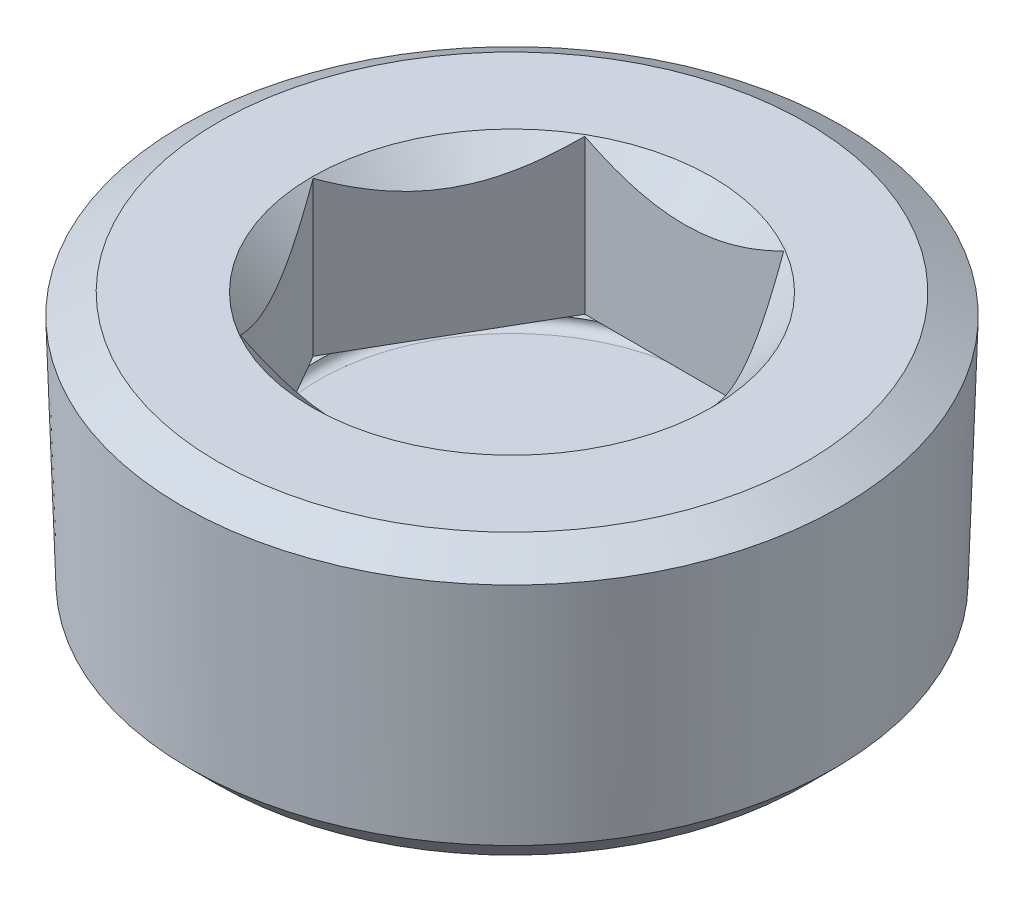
ISO-10303-21;
HEADER;
FILE_DESCRIPTION(('STEP AP214'),'2;1');
FILE_NAME('part.step','',(''),(''),'','','');
FILE_SCHEMA(('AUTOMOTIVE_DESIGN { 1 0 10303 214 1 1 1 1 }'));
ENDSEC;
DATA;
#1=APPLICATION_CONTEXT('core data for automotive mechanical design processes');
#2=APPLICATION_PROTOCOL_DEFINITION('international standard','automotive_design',2000,#1);
#3=PRODUCT_CONTEXT('',#1,'mechanical');
#4=PRODUCT('Part','Part','',(#3));
#5=PRODUCT_RELATED_PRODUCT_CATEGORY('part','',(#4));
#6=PRODUCT_DEFINITION_FORMATION('','',#4);
#7=PRODUCT_DEFINITION_CONTEXT('part definition',#1,'design');
#8=PRODUCT_DEFINITION('design','',#6,#7);
#9=PRODUCT_DEFINITION_SHAPE('','',#8);
#10=(LENGTH_UNIT() NAMED_UNIT(*) SI_UNIT(.MILLI.,.METRE.));
#11=(NAMED_UNIT(*) PLANE_ANGLE_UNIT() SI_UNIT($,.RADIAN.));
#12=(NAMED_UNIT(*) SI_UNIT($,.STERADIAN.) SOLID_ANGLE_UNIT());
#13=UNCERTAINTY_MEASURE_WITH_UNIT(LENGTH_MEASURE(1.E-05),#10,'distance_accuracy_value','');
#14=(GEOMETRIC_REPRESENTATION_CONTEXT(3) GLOBAL_UNCERTAINTY_ASSIGNED_CONTEXT((#13)) GLOBAL_UNIT_ASSIGNED_CONTEXT((#10,
#11,#12)) REPRESENTATION_CONTEXT('',''));
#15=CARTESIAN_POINT('',(0.,0.,0.));
#16=DIRECTION('',(0.,0.,1.));
#17=DIRECTION('',(1.,0.,0.));
#18=AXIS2_PLACEMENT_3D('',#15,#16,#17);
#19=CARTESIAN_POINT('',(0.,0.,0.));
#20=DIRECTION('',(0.,1.,0.));
#21=DIRECTION('',(0.,0.,1.));
#22=AXIS2_PLACEMENT_3D('',#19,#20,#21);
#23=PLANE('',#22);
#24=CARTESIAN_POINT('',(0.,0.,0.));
#25=DIRECTION('',(0.,1.,0.));
#26=DIRECTION('',(0.,0.,1.));
#27=AXIS2_PLACEMENT_3D('',#24,#25,#26);
#28=CIRCLE('',#27,14.732);
#29=CARTESIAN_POINT('',(0.,0.,14.732));
#30=VERTEX_POINT('',#29);
#31=EDGE_CURVE('E178',#30,#30,#28,.T.);
#32=ORIENTED_EDGE('',*,*,#31,.F.);
#33=EDGE_LOOP('',(#32));
#34=FACE_BOUND('',#33,.T.);
#35=CARTESIAN_POINT('',(0.,0.,0.));
#36=DIRECTION('',(0.,1.,0.));
#37=DIRECTION('',(0.,0.,1.));
#38=AXIS2_PLACEMENT_3D('',#35,#36,#37);
#39=CIRCLE('',#38,21.6827634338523);
#40=CARTESIAN_POINT('',(0.,0.,21.6827634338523));
#41=VERTEX_POINT('',#40);
#42=EDGE_CURVE('E12',#41,#41,#39,.T.);
#43=ORIENTED_EDGE('',*,*,#42,.T.);
#44=EDGE_LOOP('',(#43));
#45=FACE_BOUND('',#44,.T.);
#46=ADVANCED_FACE('F34',(#34,#45),#23,.T.);
#47=CARTESIAN_POINT('',(0.,0.,0.));
#48=DIRECTION('',(0.,-1.,0.));
#49=DIRECTION('',(0.,0.,-1.));
#50=AXIS2_PLACEMENT_3D('',#47,#48,#49);
#51=CONICAL_SURFACE('',#50,21.6827634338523,1.0471975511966);
#52=CARTESIAN_POINT('',(0.,-1.51754437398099,0.));
#53=DIRECTION('',(0.,1.,0.));
#54=DIRECTION('',(0.,0.,1.));
#55=AXIS2_PLACEMENT_3D('',#52,#53,#54);
#56=CIRCLE('',#55,24.3112273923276);
#57=CARTESIAN_POINT('',(0.,-1.51754437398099,24.3112273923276));
#58=VERTEX_POINT('',#57);
#59=EDGE_CURVE('E41',#58,#58,#56,.T.);
#60=ORIENTED_EDGE('',*,*,#59,.T.);
#61=EDGE_LOOP('',(#60));
#62=FACE_BOUND('',#61,.T.);
#63=ORIENTED_EDGE('',*,*,#42,.F.);
#64=EDGE_LOOP('',(#63));
#65=FACE_BOUND('',#64,.T.);
#66=ADVANCED_FACE('F192',(#62,#65),#51,.T.);
#67=CARTESIAN_POINT('',(0.,-1.51754437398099,0.));
#68=DIRECTION('',(0.,1.,0.));
#69=DIRECTION('',(0.,0.,1.));
#70=AXIS2_PLACEMENT_3D('',#67,#68,#69);
#71=CONICAL_SURFACE('',#70,24.3112273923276,0.0312064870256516);
#72=CARTESIAN_POINT('',(0.,-18.5273238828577,0.));
#73=DIRECTION('',(0.,1.,0.));
#74=DIRECTION('',(0.,0.,1.));
#75=AXIS2_PLACEMENT_3D('',#72,#73,#74);
#76=CIRCLE('',#75,23.7802395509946);
#77=CARTESIAN_POINT('',(0.,-18.5273238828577,23.7802395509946));
#78=VERTEX_POINT('',#77);
#79=EDGE_CURVE('E187',#78,#78,#76,.T.);
#80=ORIENTED_EDGE('',*,*,#79,.T.);
#81=EDGE_LOOP('',(#80));
#82=FACE_BOUND('',#81,.T.);
#83=ORIENTED_EDGE('',*,*,#59,.F.);
#84=EDGE_LOOP('',(#83));
#85=FACE_BOUND('',#84,.T.);
#86=ADVANCED_FACE('F195',(#82,#85),#71,.T.);
#87=CARTESIAN_POINT('',(0.,-18.5273238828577,0.));
#88=DIRECTION('',(0.,1.,0.));
#89=DIRECTION('',(0.,0.,1.));
#90=AXIS2_PLACEMENT_3D('',#87,#88,#89);
#91=CONICAL_SURFACE('',#90,23.7802395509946,0.785398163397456);
#92=CARTESIAN_POINT('',(0.,-20.6248,0.));
#93=DIRECTION('',(0.,1.,0.));
#94=DIRECTION('',(0.,0.,1.));
#95=AXIS2_PLACEMENT_3D('',#92,#93,#94);
#96=CIRCLE('',#95,21.6827634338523);
#97=CARTESIAN_POINT('',(0.,-20.6248,21.6827634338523));
#98=VERTEX_POINT('',#97);
#99=EDGE_CURVE('E184',#98,#98,#96,.T.);
#100=ORIENTED_EDGE('',*,*,#99,.T.);
#101=EDGE_LOOP('',(#100));
#102=FACE_BOUND('',#101,.T.);
#103=ORIENTED_EDGE('',*,*,#79,.F.);
#104=EDGE_LOOP('',(#103));
#105=FACE_BOUND('',#104,.T.);
#106=ADVANCED_FACE('F197',(#102,#105),#91,.T.);
#107=CARTESIAN_POINT('',(-21.6827634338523,-20.6248,0.));
#108=DIRECTION('',(0.,-1.,0.));
#109=DIRECTION('',(0.,0.,-1.));
#110=AXIS2_PLACEMENT_3D('',#107,#108,#109);
#111=PLANE('',#110);
#112=ORIENTED_EDGE('',*,*,#99,.F.);
#113=EDGE_LOOP('',(#112));
#114=FACE_BOUND('',#113,.T.);
#115=ADVANCED_FACE('F204',(#114),#111,.T.);
#116=CARTESIAN_POINT('',(0.,0.,0.));
#117=DIRECTION('',(0.,1.,0.));
#118=DIRECTION('',(0.,0.,1.));
#119=AXIS2_PLACEMENT_3D('',#116,#117,#118);
#120=CONICAL_SURFACE('',#119,14.732,0.785398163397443);
#121=CARTESIAN_POINT('',(-15.3291894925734,5.17463332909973,12.7));
#122=CARTESIAN_POINT('',(-14.9589479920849,4.88959123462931,12.7));
#123=CARTESIAN_POINT('',(-14.5867146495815,4.60709574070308,12.7));
#124=CARTESIAN_POINT('',(-13.8374490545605,4.04836230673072,12.7));
#125=CARTESIAN_POINT('',(-13.4604156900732,3.77212585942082,12.7));
#126=CARTESIAN_POINT('',(-12.6979798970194,3.22510913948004,12.7));
#127=CARTESIAN_POINT('',(-12.3125353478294,2.95438738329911,12.7));
#128=CARTESIAN_POINT('',(-11.5352366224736,2.42233918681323,12.7));
#129=CARTESIAN_POINT('',(-11.1433828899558,2.16101210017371,12.7));
#130=CARTESIAN_POINT('',(-10.3270006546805,1.63362575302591,12.7));
#131=CARTESIAN_POINT('',(-9.90198012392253,1.36832433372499,12.7));
#132=CARTESIAN_POINT('',(-9.0419558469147,0.854150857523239,12.7));
#133=CARTESIAN_POINT('',(-8.60695043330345,0.605281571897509,12.7));
#134=CARTESIAN_POINT('',(-7.72683347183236,0.129269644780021,12.7));
#135=CARTESIAN_POINT('',(-7.28175668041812,-0.0979367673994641,12.7));
#136=CARTESIAN_POINT('',(-6.3789973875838,-0.525532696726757,12.7));
#137=CARTESIAN_POINT('',(-5.92132096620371,-0.725934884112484,12.7));
#138=CARTESIAN_POINT('',(-5.03853629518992,-1.07443088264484,12.7));
#139=CARTESIAN_POINT('',(-4.61470922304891,-1.22574334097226,12.7));
#140=CARTESIAN_POINT('',(-3.75615169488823,-1.49444779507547,12.7));
#141=CARTESIAN_POINT('',(-3.32142054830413,-1.6118376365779,12.7));
#142=CARTESIAN_POINT('',(-2.66688443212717,-1.75671421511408,12.7));
#143=CARTESIAN_POINT('',(-2.45041353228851,-1.79953502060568,12.7));
#144=CARTESIAN_POINT('',(-2.01568738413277,-1.87481478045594,12.7));
#145=CARTESIAN_POINT('',(-1.79743238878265,-1.90727517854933,12.7));
#146=CARTESIAN_POINT('',(-1.35959203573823,-1.96127985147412,12.7));
#147=CARTESIAN_POINT('',(-1.14000679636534,-1.98282508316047,12.7));
#148=CARTESIAN_POINT('',(-0.700016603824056,-2.0146147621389,12.7));
#149=CARTESIAN_POINT('',(-0.479611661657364,-2.02485936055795,12.7));
#150=CARTESIAN_POINT('',(-0.048288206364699,-2.03365728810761,12.7));
#151=CARTESIAN_POINT('',(0.162620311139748,-2.0327059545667,12.7));
#152=CARTESIAN_POINT('',(0.584151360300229,-2.02031870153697,12.7));
#153=CARTESIAN_POINT('',(0.794773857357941,-2.00888161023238,12.7));
#154=CARTESIAN_POINT('',(1.21519356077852,-1.97571555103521,12.7));
#155=CARTESIAN_POINT('',(1.42499081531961,-1.95398719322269,12.7));
#156=CARTESIAN_POINT('',(1.84332802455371,-1.90060227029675,12.7));
#157=CARTESIAN_POINT('',(2.05186780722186,-1.86894437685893,12.7));
#158=CARTESIAN_POINT('',(2.68244777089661,-1.75846982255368,12.7));
#159=CARTESIAN_POINT('',(3.10194616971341,-1.66476681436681,12.7));
#160=CARTESIAN_POINT('',(3.93162363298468,-1.44337797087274,12.7));
#161=CARTESIAN_POINT('',(4.34180321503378,-1.31569402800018,12.7));
#162=CARTESIAN_POINT('',(5.17500836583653,-1.02397670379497,12.7));
#163=CARTESIAN_POINT('',(5.59745269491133,-0.858298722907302,12.7));
#164=CARTESIAN_POINT('',(6.43147266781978,-0.501341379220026,12.7));
#165=CARTESIAN_POINT('',(6.84304331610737,-0.310050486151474,12.7));
#166=CARTESIAN_POINT('',(7.65726509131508,0.0935964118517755,12.7));
#167=CARTESIAN_POINT('',(8.05988381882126,0.306017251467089,12.7));
#168=CARTESIAN_POINT('',(8.85589628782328,0.747250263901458,12.7));
#169=CARTESIAN_POINT('',(9.24929143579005,0.976059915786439,12.7));
#170=CARTESIAN_POINT('',(10.008839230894,1.43524962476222,12.7));
#171=CARTESIAN_POINT('',(10.37537796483,1.66499441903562,12.7));
#172=CARTESIAN_POINT('',(11.1021578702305,2.13426677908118,12.7));
#173=CARTESIAN_POINT('',(11.4623985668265,2.37379507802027,12.7));
#174=CARTESIAN_POINT('',(12.1745109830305,2.85894094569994,12.7));
#175=CARTESIAN_POINT('',(12.5264266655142,3.10449421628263,12.7));
#176=CARTESIAN_POINT('',(13.2254296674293,3.60218595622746,12.7));
#177=CARTESIAN_POINT('',(13.5725182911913,3.85432259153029,12.7));
#178=CARTESIAN_POINT('',(13.917581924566,4.10915406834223,12.7));
#179=B_SPLINE_CURVE_WITH_KNOTS('',3,(#121,#122,#123,#124,#125,#126,#127,#128,#129,#130,#131,
#132,#133,#134,#135,#136,#137,#138,#139,#140,#141,#142,#143,#144,#145,#146,#147,#148,#149,#150,
#151,#152,#153,#154,#155,#156,#157,#158,#159,#160,#161,#162,#163,#164,#165,#166,#167,#168,#169,
#170,#171,#172,#173,#174,#175,#176,#177,#178),.UNSPECIFIED.,.F.,.F.,(4,2,2,2,2,2,2,2,2,2,2,2,2,
2,2,2,2,2,2,2,2,2,2,2,2,2,2,2,4),(0.,1.40179234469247,2.80391556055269,4.21685329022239,
5.62969362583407,7.13247727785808,8.63551372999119,10.1339793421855,11.6317341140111,
12.9807032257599,14.3297579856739,14.991546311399,15.6532423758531,16.3148804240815,
16.9765096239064,17.608980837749,18.2415227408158,18.8740271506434,19.5066162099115,
20.7942875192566,22.0818871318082,23.4421454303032,24.8030181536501,26.168203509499,
27.5331793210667,28.8307644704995,30.128447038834,31.4157149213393,32.7026279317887),.UNSPECIFIED.);
#180=CARTESIAN_POINT('',(7.33234841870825,-0.0673031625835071,12.7));
#181=VERTEX_POINT('',#180);
#182=CARTESIAN_POINT('',(-7.33234841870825,-0.0673031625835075,12.7));
#183=VERTEX_POINT('',#182);
#184=EDGE_CURVE('E48',#181,#183,#179,.F.);
#185=ORIENTED_EDGE('',*,*,#184,.T.);
#186=CARTESIAN_POINT('',(-7.33223294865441,-0.0671876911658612,12.7002));
#187=CARTESIAN_POINT('',(-7.45829190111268,-0.193227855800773,12.4818594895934));
#188=CARTESIAN_POINT('',(-7.58533809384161,-0.315421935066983,12.2618090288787));
#189=CARTESIAN_POINT('',(-7.84155862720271,-0.550896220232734,11.8180220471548));
#190=CARTESIAN_POINT('',(-7.97073408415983,-0.66417155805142,11.5942835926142));
#191=CARTESIAN_POINT('',(-8.23197607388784,-0.881066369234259,11.1417991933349));
#192=CARTESIAN_POINT('',(-8.364054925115,-0.984626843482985,10.9130319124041));
#193=CARTESIAN_POINT('',(-8.63038195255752,-1.17984271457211,10.4517399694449));
#194=CARTESIAN_POINT('',(-8.76462979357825,-1.27149993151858,10.2192158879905));
#195=CARTESIAN_POINT('',(-9.03313634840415,-1.44000927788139,9.75414889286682));
#196=CARTESIAN_POINT('',(-9.16736206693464,-1.51707050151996,9.52166312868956));
#197=CARTESIAN_POINT('',(-9.43769508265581,-1.65658272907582,9.05343261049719));
#198=CARTESIAN_POINT('',(-9.57380217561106,-1.71903530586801,8.81768821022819));
#199=CARTESIAN_POINT('',(-9.84731577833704,-1.82775795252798,8.34394875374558));
#200=CARTESIAN_POINT('',(-9.98471863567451,-1.874064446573,8.10596002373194));
#201=CARTESIAN_POINT('',(-10.2606778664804,-1.94947741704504,7.62798461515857));
#202=CARTESIAN_POINT('',(-10.3992340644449,-1.97858646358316,7.38799824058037));
#203=CARTESIAN_POINT('',(-10.7368852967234,-2.02739428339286,6.80316915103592));
#204=CARTESIAN_POINT('',(-10.9363452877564,-2.03763638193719,6.45769431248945));
#205=CARTESIAN_POINT('',(-11.3349045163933,-2.02044398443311,5.7673694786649));
#206=CARTESIAN_POINT('',(-11.5340036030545,-1.99299628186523,5.4225197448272));
#207=CARTESIAN_POINT('',(-11.9303249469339,-1.90204439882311,4.7360710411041));
#208=CARTESIAN_POINT('',(-12.1275448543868,-1.83849990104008,4.39447614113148));
#209=CARTESIAN_POINT('',(-12.5185948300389,-1.67880849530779,3.7171577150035));
#210=CARTESIAN_POINT('',(-12.7124251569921,-1.58266408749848,3.38143374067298));
#211=CARTESIAN_POINT('',(-13.0564965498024,-1.38487297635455,2.78548460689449));
#212=CARTESIAN_POINT('',(-13.207499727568,-1.28842963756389,2.52393943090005));
#213=CARTESIAN_POINT('',(-13.5067956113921,-1.08000258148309,2.00554375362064));
#214=CARTESIAN_POINT('',(-13.6550882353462,-0.968018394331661,1.74869339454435));
#215=CARTESIAN_POINT('',(-13.9484959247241,-0.731019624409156,1.24049636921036));
#216=CARTESIAN_POINT('',(-14.0936193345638,-0.606046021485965,0.989135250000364));
#217=CARTESIAN_POINT('',(-14.3811790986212,-0.34470890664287,0.491067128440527));
#218=CARTESIAN_POINT('',(-14.5236170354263,-0.208352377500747,0.2443573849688));
#219=CARTESIAN_POINT('',(-14.6648123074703,-0.0671876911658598,-0.00019999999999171));
#220=B_SPLINE_CURVE_WITH_KNOTS('',3,(#186,#187,#188,#189,#190,#191,#192,#193,#194,#195,#196,
#197,#198,#199,#200,#201,#202,#203,#204,#205,#206,#207,#208,#209,#210,#211,#212,#213,#214,#215,
#216,#217,#218,#219),.UNSPECIFIED.,.F.,.F.,(4,2,2,2,2,2,2,2,2,2,2,2,2,2,2,2,4),(0.,
0.845639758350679,1.69173793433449,2.54268053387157,3.39349286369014,4.23100113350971,
5.06841918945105,5.90393569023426,6.73932729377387,7.9346157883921,9.13032321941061,
10.3273687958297,11.5243225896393,12.4749718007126,13.4256497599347,14.3734146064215,
15.3206022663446),.UNSPECIFIED.);
#221=CARTESIAN_POINT('',(-14.6646968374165,-0.0673031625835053,0.));
#222=VERTEX_POINT('',#221);
#223=EDGE_CURVE('E141',#183,#222,#220,.T.);
#224=ORIENTED_EDGE('',*,*,#223,.T.);
#225=CARTESIAN_POINT('',(-14.6648123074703,-0.0671876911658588,0.00020000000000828));
#226=CARTESIAN_POINT('',(-14.5387533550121,-0.193227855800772,-0.218140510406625));
#227=CARTESIAN_POINT('',(-14.4117071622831,-0.315421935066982,-0.438190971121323));
#228=CARTESIAN_POINT('',(-14.155486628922,-0.550896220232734,-0.881977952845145));
#229=CARTESIAN_POINT('',(-14.0263111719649,-0.66417155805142,-1.10571640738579));
#230=CARTESIAN_POINT('',(-13.7650691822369,-0.881066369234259,-1.5582008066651));
#231=CARTESIAN_POINT('',(-13.6329903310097,-0.984626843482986,-1.78696808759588));
#232=CARTESIAN_POINT('',(-13.3666633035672,-1.17984271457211,-2.24826003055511));
#233=CARTESIAN_POINT('',(-13.2324154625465,-1.27149993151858,-2.48078411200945));
#234=CARTESIAN_POINT('',(-12.9639089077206,-1.44000927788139,-2.94585110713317));
#235=CARTESIAN_POINT('',(-12.8296831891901,-1.51707050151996,-3.17833687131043));
#236=CARTESIAN_POINT('',(-12.5593501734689,-1.65658272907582,-3.64656738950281));
#237=CARTESIAN_POINT('',(-12.4232430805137,-1.71903530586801,-3.8823117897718));
#238=CARTESIAN_POINT('',(-12.1497294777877,-1.82775795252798,-4.35605124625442));
#239=CARTESIAN_POINT('',(-12.0123266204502,-1.87406444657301,-4.59403997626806));
#240=CARTESIAN_POINT('',(-11.7363673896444,-1.94947741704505,-5.07201538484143));
#241=CARTESIAN_POINT('',(-11.5978111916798,-1.97858646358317,-5.31200175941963));
#242=CARTESIAN_POINT('',(-11.2601599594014,-2.02739428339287,-5.89683084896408));
#243=CARTESIAN_POINT('',(-11.0606999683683,-2.03763638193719,-6.24230568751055));
#244=CARTESIAN_POINT('',(-10.6621407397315,-2.02044398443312,-6.9326305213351));
#245=CARTESIAN_POINT('',(-10.4630416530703,-1.99299628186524,-7.2774802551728));
#246=CARTESIAN_POINT('',(-10.0667203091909,-1.90204439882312,-7.9639289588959));
#247=CARTESIAN_POINT('',(-9.86950040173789,-1.83849990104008,-8.30552385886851));
#248=CARTESIAN_POINT('',(-9.47845042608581,-1.67880849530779,-8.9828422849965));
#249=CARTESIAN_POINT('',(-9.28462009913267,-1.58266408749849,-9.31856625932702));
#250=CARTESIAN_POINT('',(-8.94054870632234,-1.38487297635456,-9.91451539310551));
#251=CARTESIAN_POINT('',(-8.7895455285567,-1.2884296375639,-10.1760605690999));
#252=CARTESIAN_POINT('',(-8.49024964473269,-1.0800025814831,-10.6944562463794));
#253=CARTESIAN_POINT('',(-8.34195702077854,-0.968018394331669,-10.9513066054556));
#254=CARTESIAN_POINT('',(-8.0485493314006,-0.731019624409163,-11.4595036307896));
#255=CARTESIAN_POINT('',(-7.9034259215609,-0.606046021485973,-11.7108647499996));
#256=CARTESIAN_POINT('',(-7.61586615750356,-0.344708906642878,-12.2089328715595));
#257=CARTESIAN_POINT('',(-7.47342822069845,-0.208352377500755,-12.4556426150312));
#258=CARTESIAN_POINT('',(-7.33223294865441,-0.0671876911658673,-12.7002));
#259=B_SPLINE_CURVE_WITH_KNOTS('',3,(#225,#226,#227,#228,#229,#230,#231,#232,#233,#234,#235,
#236,#237,#238,#239,#240,#241,#242,#243,#244,#245,#246,#247,#248,#249,#250,#251,#252,#253,#254,
#255,#256,#257,#258),.UNSPECIFIED.,.F.,.F.,(4,2,2,2,2,2,2,2,2,2,2,2,2,2,2,2,4),(0.,
0.84563975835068,1.6917379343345,2.54268053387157,3.39349286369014,4.23100113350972,
5.06841918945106,5.90393569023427,6.73932729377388,7.93461578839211,9.13032321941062,
10.3273687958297,11.5243225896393,12.4749718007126,13.4256497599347,14.3734146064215,
15.3206022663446),.UNSPECIFIED.);
#260=CARTESIAN_POINT('',(-7.33234841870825,-0.0673031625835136,-12.7));
#261=VERTEX_POINT('',#260);
#262=EDGE_CURVE('E263',#222,#261,#259,.T.);
#263=ORIENTED_EDGE('',*,*,#262,.T.);
#264=CARTESIAN_POINT('',(-15.3291894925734,5.17463332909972,-12.7));
#265=CARTESIAN_POINT('',(-14.9589479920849,4.8895912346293,-12.7));
#266=CARTESIAN_POINT('',(-14.5867146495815,4.60709574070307,-12.7));
#267=CARTESIAN_POINT('',(-13.8374490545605,4.04836230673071,-12.7));
#268=CARTESIAN_POINT('',(-13.4604156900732,3.77212585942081,-12.7));
#269=CARTESIAN_POINT('',(-12.6979798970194,3.22510913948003,-12.7));
#270=CARTESIAN_POINT('',(-12.3125353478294,2.95438738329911,-12.7));
#271=CARTESIAN_POINT('',(-11.5352366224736,2.42233918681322,-12.7));
#272=CARTESIAN_POINT('',(-11.1433828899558,2.1610121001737,-12.7));
#273=CARTESIAN_POINT('',(-10.3270006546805,1.6336257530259,-12.7));
#274=CARTESIAN_POINT('',(-9.90198012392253,1.36832433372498,-12.7));
#275=CARTESIAN_POINT('',(-9.0419558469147,0.854150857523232,-12.7));
#276=CARTESIAN_POINT('',(-8.60695043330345,0.6052815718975,-12.7));
#277=CARTESIAN_POINT('',(-7.72683347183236,0.129269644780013,-12.7));
#278=CARTESIAN_POINT('',(-7.28175668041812,-0.0979367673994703,-12.7));
#279=CARTESIAN_POINT('',(-6.3789973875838,-0.525532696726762,-12.7));
#280=CARTESIAN_POINT('',(-5.92132096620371,-0.725934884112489,-12.7));
#281=CARTESIAN_POINT('',(-5.03853629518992,-1.07443088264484,-12.7));
#282=CARTESIAN_POINT('',(-4.61470922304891,-1.22574334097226,-12.7));
#283=CARTESIAN_POINT('',(-3.75615169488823,-1.49444779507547,-12.7));
#284=CARTESIAN_POINT('',(-3.32142054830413,-1.6118376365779,-12.7));
#285=CARTESIAN_POINT('',(-2.66688443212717,-1.75671421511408,-12.7));
#286=CARTESIAN_POINT('',(-2.45041353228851,-1.79953502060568,-12.7));
#287=CARTESIAN_POINT('',(-2.01568738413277,-1.87481478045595,-12.7));
#288=CARTESIAN_POINT('',(-1.79743238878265,-1.90727517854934,-12.7));
#289=CARTESIAN_POINT('',(-1.35959203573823,-1.96127985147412,-12.7));
#290=CARTESIAN_POINT('',(-1.14000679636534,-1.98282508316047,-12.7));
#291=CARTESIAN_POINT('',(-0.70001660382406,-2.01461476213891,-12.7));
#292=CARTESIAN_POINT('',(-0.479611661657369,-2.02485936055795,-12.7));
#293=CARTESIAN_POINT('',(-0.0482882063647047,-2.03365728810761,-12.7));
#294=CARTESIAN_POINT('',(0.162620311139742,-2.03270595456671,-12.7));
#295=CARTESIAN_POINT('',(0.584151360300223,-2.02031870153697,-12.7));
#296=CARTESIAN_POINT('',(0.794773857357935,-2.00888161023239,-12.7));
#297=CARTESIAN_POINT('',(1.21519356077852,-1.97571555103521,-12.7));
#298=CARTESIAN_POINT('',(1.4249908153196,-1.95398719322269,-12.7));
#299=CARTESIAN_POINT('',(1.8433280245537,-1.90060227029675,-12.7));
#300=CARTESIAN_POINT('',(2.05186780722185,-1.86894437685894,-12.7));
#301=CARTESIAN_POINT('',(2.6824477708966,-1.75846982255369,-12.7));
#302=CARTESIAN_POINT('',(3.1019461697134,-1.66476681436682,-12.7));
#303=CARTESIAN_POINT('',(3.93162363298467,-1.44337797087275,-12.7));
#304=CARTESIAN_POINT('',(4.34180321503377,-1.31569402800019,-12.7));
#305=CARTESIAN_POINT('',(5.17500836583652,-1.02397670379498,-12.7));
#306=CARTESIAN_POINT('',(5.59745269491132,-0.858298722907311,-12.7));
#307=CARTESIAN_POINT('',(6.43147266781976,-0.501341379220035,-12.7));
#308=CARTESIAN_POINT('',(6.84304331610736,-0.310050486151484,-12.7));
#309=CARTESIAN_POINT('',(7.65726509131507,0.0935964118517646,-12.7));
#310=CARTESIAN_POINT('',(8.05988381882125,0.306017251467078,-12.7));
#311=CARTESIAN_POINT('',(8.85589628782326,0.747250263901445,-12.7));
#312=CARTESIAN_POINT('',(9.24929143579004,0.976059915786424,-12.7));
#313=CARTESIAN_POINT('',(10.008839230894,1.43524962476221,-12.7));
#314=CARTESIAN_POINT('',(10.3753779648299,1.66499441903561,-12.7));
#315=CARTESIAN_POINT('',(11.1021578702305,2.13426677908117,-12.7));
#316=CARTESIAN_POINT('',(11.4623985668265,2.37379507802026,-12.7));
#317=CARTESIAN_POINT('',(12.1745109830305,2.85894094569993,-12.7));
#318=CARTESIAN_POINT('',(12.5264266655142,3.10449421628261,-12.7));
#319=CARTESIAN_POINT('',(13.2254296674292,3.60218595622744,-12.7));
#320=CARTESIAN_POINT('',(13.5725182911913,3.85432259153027,-12.7));
#321=CARTESIAN_POINT('',(13.917581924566,4.10915406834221,-12.7));
#322=B_SPLINE_CURVE_WITH_KNOTS('',3,(#264,#265,#266,#267,#268,#269,#270,#271,#272,#273,#274,
#275,#276,#277,#278,#279,#280,#281,#282,#283,#284,#285,#286,#287,#288,#289,#290,#291,#292,#293,
#294,#295,#296,#297,#298,#299,#300,#301,#302,#303,#304,#305,#306,#307,#308,#309,#310,#311,#312,
#313,#314,#315,#316,#317,#318,#319,#320,#321),.UNSPECIFIED.,.F.,.F.,(4,2,2,2,2,2,2,2,2,2,2,2,2,
2,2,2,2,2,2,2,2,2,2,2,2,2,2,2,4),(0.,1.40179234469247,2.80391556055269,4.21685329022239,
5.62969362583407,7.13247727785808,8.63551372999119,10.1339793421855,11.6317341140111,
12.9807032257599,14.3297579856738,14.991546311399,15.6532423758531,16.3148804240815,
16.9765096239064,17.608980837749,18.2415227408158,18.8740271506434,19.5066162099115,
20.7942875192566,22.0818871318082,23.4421454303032,24.80301815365,26.168203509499,
27.5331793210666,28.8307644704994,30.128447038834,31.4157149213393,32.7026279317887),.UNSPECIFIED.);
#323=CARTESIAN_POINT('',(7.33234841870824,-0.0673031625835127,-12.7));
#324=VERTEX_POINT('',#323);
#325=EDGE_CURVE('E256',#261,#324,#322,.T.);
#326=ORIENTED_EDGE('',*,*,#325,.T.);
#327=CARTESIAN_POINT('',(7.33223294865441,-0.0671876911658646,-12.7002));
#328=CARTESIAN_POINT('',(7.45829190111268,-0.193227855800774,-12.4818594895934));
#329=CARTESIAN_POINT('',(7.58533809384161,-0.315421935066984,-12.2618090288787));
#330=CARTESIAN_POINT('',(7.84155862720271,-0.550896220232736,-11.8180220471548));
#331=CARTESIAN_POINT('',(7.97073408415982,-0.664171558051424,-11.5942835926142));
#332=CARTESIAN_POINT('',(8.23197607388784,-0.881066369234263,-11.1417991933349));
#333=CARTESIAN_POINT('',(8.364054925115,-0.984626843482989,-10.9130319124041));
#334=CARTESIAN_POINT('',(8.63038195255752,-1.17984271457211,-10.4517399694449));
#335=CARTESIAN_POINT('',(8.76462979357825,-1.27149993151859,-10.2192158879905));
#336=CARTESIAN_POINT('',(9.03313634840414,-1.44000927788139,-9.75414889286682));
#337=CARTESIAN_POINT('',(9.16736206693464,-1.51707050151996,-9.52166312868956));
#338=CARTESIAN_POINT('',(9.43769508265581,-1.65658272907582,-9.05343261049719));
#339=CARTESIAN_POINT('',(9.57380217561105,-1.71903530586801,-8.81768821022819));
#340=CARTESIAN_POINT('',(9.84731577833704,-1.82775795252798,-8.34394875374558));
#341=CARTESIAN_POINT('',(9.98471863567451,-1.874064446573,-8.10596002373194));
#342=CARTESIAN_POINT('',(10.2606778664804,-1.94947741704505,-7.62798461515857));
#343=CARTESIAN_POINT('',(10.3992340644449,-1.97858646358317,-7.38799824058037));
#344=CARTESIAN_POINT('',(10.7368852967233,-2.02739428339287,-6.80316915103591));
#345=CARTESIAN_POINT('',(10.9363452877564,-2.03763638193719,-6.45769431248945));
#346=CARTESIAN_POINT('',(11.3349045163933,-2.02044398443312,-5.7673694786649));
#347=CARTESIAN_POINT('',(11.5340036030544,-1.99299628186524,-5.4225197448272));
#348=CARTESIAN_POINT('',(11.9303249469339,-1.90204439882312,-4.7360710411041));
#349=CARTESIAN_POINT('',(12.1275448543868,-1.83849990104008,-4.39447614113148));
#350=CARTESIAN_POINT('',(12.5185948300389,-1.67880849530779,-3.7171577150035));
#351=CARTESIAN_POINT('',(12.7124251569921,-1.58266408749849,-3.38143374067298));
#352=CARTESIAN_POINT('',(13.0564965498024,-1.38487297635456,-2.78548460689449));
#353=CARTESIAN_POINT('',(13.207499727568,-1.2884296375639,-2.52393943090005));
#354=CARTESIAN_POINT('',(13.506795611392,-1.0800025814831,-2.00554375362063));
#355=CARTESIAN_POINT('',(13.6550882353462,-0.968018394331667,-1.74869339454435));
#356=CARTESIAN_POINT('',(13.9484959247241,-0.73101962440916,-1.24049636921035));
#357=CARTESIAN_POINT('',(14.0936193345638,-0.60604602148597,-0.989135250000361));
#358=CARTESIAN_POINT('',(14.3811790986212,-0.344708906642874,-0.491067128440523));
#359=CARTESIAN_POINT('',(14.5236170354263,-0.208352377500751,-0.244357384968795));
#360=CARTESIAN_POINT('',(14.6648123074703,-0.0671876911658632,0.000199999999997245));
#361=B_SPLINE_CURVE_WITH_KNOTS('',3,(#327,#328,#329,#330,#331,#332,#333,#334,#335,#336,#337,
#338,#339,#340,#341,#342,#343,#344,#345,#346,#347,#348,#349,#350,#351,#352,#353,#354,#355,#356,
#357,#358,#359,#360),.UNSPECIFIED.,.F.,.F.,(4,2,2,2,2,2,2,2,2,2,2,2,2,2,2,2,4),(0.,
0.845639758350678,1.69173793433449,2.54268053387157,3.39349286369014,4.23100113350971,
5.06841918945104,5.90393569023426,6.73932729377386,7.93461578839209,9.1303232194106,
10.3273687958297,11.5243225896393,12.4749718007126,13.4256497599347,14.3734146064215,
15.3206022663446),.UNSPECIFIED.);
#362=CARTESIAN_POINT('',(14.6646968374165,-0.0673031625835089,0.));
#363=VERTEX_POINT('',#362);
#364=EDGE_CURVE('E249',#324,#363,#361,.T.);
#365=ORIENTED_EDGE('',*,*,#364,.T.);
#366=CARTESIAN_POINT('',(14.6648123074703,-0.0671876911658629,-0.000200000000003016));
#367=CARTESIAN_POINT('',(14.5387533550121,-0.193227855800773,0.21814051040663));
#368=CARTESIAN_POINT('',(14.4117071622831,-0.315421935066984,0.438190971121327));
#369=CARTESIAN_POINT('',(14.155486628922,-0.550896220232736,0.88197795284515));
#370=CARTESIAN_POINT('',(14.0263111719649,-0.664171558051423,1.1057164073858));
#371=CARTESIAN_POINT('',(13.7650691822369,-0.881066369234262,1.55820080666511));
#372=CARTESIAN_POINT('',(13.6329903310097,-0.984626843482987,1.78696808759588));
#373=CARTESIAN_POINT('',(13.3666633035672,-1.17984271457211,2.24826003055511));
#374=CARTESIAN_POINT('',(13.2324154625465,-1.27149993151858,2.48078411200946));
#375=CARTESIAN_POINT('',(12.9639089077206,-1.44000927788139,2.94585110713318));
#376=CARTESIAN_POINT('',(12.8296831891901,-1.51707050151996,3.17833687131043));
#377=CARTESIAN_POINT('',(12.5593501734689,-1.65658272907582,3.64656738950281));
#378=CARTESIAN_POINT('',(12.4232430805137,-1.71903530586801,3.8823117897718));
#379=CARTESIAN_POINT('',(12.1497294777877,-1.82775795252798,4.35605124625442));
#380=CARTESIAN_POINT('',(12.0123266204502,-1.874064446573,4.59403997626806));
#381=CARTESIAN_POINT('',(11.7363673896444,-1.94947741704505,5.07201538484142));
#382=CARTESIAN_POINT('',(11.5978111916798,-1.97858646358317,5.31200175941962));
#383=CARTESIAN_POINT('',(11.2601599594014,-2.02739428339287,5.89683084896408));
#384=CARTESIAN_POINT('',(11.0606999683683,-2.03763638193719,6.24230568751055));
#385=CARTESIAN_POINT('',(10.6621407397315,-2.02044398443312,6.93263052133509));
#386=CARTESIAN_POINT('',(10.4630416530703,-1.99299628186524,7.27748025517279));
#387=CARTESIAN_POINT('',(10.0667203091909,-1.90204439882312,7.9639289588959));
#388=CARTESIAN_POINT('',(9.8695004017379,-1.83849990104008,8.30552385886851));
#389=CARTESIAN_POINT('',(9.47845042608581,-1.67880849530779,8.9828422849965));
#390=CARTESIAN_POINT('',(9.28462009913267,-1.58266408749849,9.31856625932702));
#391=CARTESIAN_POINT('',(8.94054870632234,-1.38487297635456,9.9145153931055));
#392=CARTESIAN_POINT('',(8.7895455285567,-1.2884296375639,10.1760605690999));
#393=CARTESIAN_POINT('',(8.49024964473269,-1.0800025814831,10.6944562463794));
#394=CARTESIAN_POINT('',(8.34195702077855,-0.968018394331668,10.9513066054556));
#395=CARTESIAN_POINT('',(8.0485493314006,-0.73101962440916,11.4595036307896));
#396=CARTESIAN_POINT('',(7.9034259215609,-0.606046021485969,11.7108647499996));
#397=CARTESIAN_POINT('',(7.61586615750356,-0.344708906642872,12.2089328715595));
#398=CARTESIAN_POINT('',(7.47342822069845,-0.208352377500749,12.4556426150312));
#399=CARTESIAN_POINT('',(7.33223294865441,-0.0671876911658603,12.7002));
#400=B_SPLINE_CURVE_WITH_KNOTS('',3,(#366,#367,#368,#369,#370,#371,#372,#373,#374,#375,#376,
#377,#378,#379,#380,#381,#382,#383,#384,#385,#386,#387,#388,#389,#390,#391,#392,#393,#394,#395,
#396,#397,#398,#399),.UNSPECIFIED.,.F.,.F.,(4,2,2,2,2,2,2,2,2,2,2,2,2,2,2,2,4),(0.,
0.845639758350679,1.69173793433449,2.54268053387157,3.39349286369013,4.23100113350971,
5.06841918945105,5.90393569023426,6.73932729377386,7.93461578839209,9.1303232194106,
10.3273687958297,11.5243225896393,12.4749718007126,13.4256497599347,14.3734146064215,
15.3206022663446),.UNSPECIFIED.);
#401=EDGE_CURVE('E241',#363,#181,#400,.T.);
#402=ORIENTED_EDGE('',*,*,#401,.T.);
#403=EDGE_LOOP('',(#185,#224,#263,#326,#365,#402));
#404=FACE_BOUND('',#403,.T.);
#405=ORIENTED_EDGE('',*,*,#31,.T.);
#406=EDGE_LOOP('',(#405));
#407=FACE_BOUND('',#406,.T.);
#408=ADVANCED_FACE('F215',(#404,#407),#120,.F.);
#409=CARTESIAN_POINT('',(-14.6646968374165,-11.43,0.));
#410=DIRECTION('',(-0.866025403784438,0.,0.5));
#411=DIRECTION('',(0.5,0.,0.866025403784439));
#412=AXIS2_PLACEMENT_3D('',#409,#410,#411);
#413=PLANE('',#412);
#414=DIRECTION('',(0.,1.,0.));
#415=VECTOR('',#414,1.);
#416=CARTESIAN_POINT('',(-7.33234841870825,-11.43,12.7));
#417=LINE('',#416,#415);
#418=CARTESIAN_POINT('',(-7.33234841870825,-11.43,12.7));
#419=VERTEX_POINT('',#418);
#420=EDGE_CURVE('E138',#419,#183,#417,.T.);
#421=ORIENTED_EDGE('',*,*,#420,.F.);
#422=DIRECTION('',(0.5,0.,0.866025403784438));
#423=VECTOR('',#422,1.);
#424=CARTESIAN_POINT('',(-14.6646968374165,-11.43,0.));
#425=LINE('',#424,#423);
#426=CARTESIAN_POINT('',(-7.79570449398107,-11.43,11.8974437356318));
#427=VERTEX_POINT('',#426);
#428=EDGE_CURVE('E124',#427,#419,#425,.T.);
#429=ORIENTED_EDGE('',*,*,#428,.F.);
#430=CARTESIAN_POINT('',(-14.2013407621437,-11.43,0.802556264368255));
#431=VERTEX_POINT('',#430);
#432=EDGE_CURVE('E134',#431,#427,#425,.T.);
#433=ORIENTED_EDGE('',*,*,#432,.F.);
#434=CARTESIAN_POINT('',(-14.6646968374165,-11.43,0.));
#435=VERTEX_POINT('',#434);
#436=EDGE_CURVE('E136',#435,#431,#425,.T.);
#437=ORIENTED_EDGE('',*,*,#436,.F.);
#438=DIRECTION('',(0.,1.,0.));
#439=VECTOR('',#438,1.);
#440=CARTESIAN_POINT('',(-14.6646968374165,-11.43,0.));
#441=LINE('',#440,#439);
#442=EDGE_CURVE('E310',#435,#222,#441,.T.);
#443=ORIENTED_EDGE('',*,*,#442,.T.);
#444=ORIENTED_EDGE('',*,*,#223,.F.);
#445=EDGE_LOOP('',(#421,#429,#433,#437,#443,#444));
#446=FACE_BOUND('',#445,.T.);
#447=ADVANCED_FACE('F139',(#446),#413,.F.);
#448=CARTESIAN_POINT('',(-7.33234841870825,-11.43,-12.7));
#449=DIRECTION('',(-0.866025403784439,0.,-0.5));
#450=DIRECTION('',(-0.5,0.,0.866025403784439));
#451=AXIS2_PLACEMENT_3D('',#448,#449,#450);
#452=PLANE('',#451);
#453=ORIENTED_EDGE('',*,*,#442,.F.);
#454=DIRECTION('',(-0.5,0.,0.866025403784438));
#455=VECTOR('',#454,1.);
#456=CARTESIAN_POINT('',(-7.33234841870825,-11.43,-12.7));
#457=LINE('',#456,#455);
#458=CARTESIAN_POINT('',(-14.2013407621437,-11.43,-0.802556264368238));
#459=VERTEX_POINT('',#458);
#460=EDGE_CURVE('E350',#459,#435,#457,.T.);
#461=ORIENTED_EDGE('',*,*,#460,.F.);
#462=CARTESIAN_POINT('',(-7.79570449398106,-11.43,-11.8974437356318));
#463=VERTEX_POINT('',#462);
#464=EDGE_CURVE('E348',#463,#459,#457,.T.);
#465=ORIENTED_EDGE('',*,*,#464,.F.);
#466=CARTESIAN_POINT('',(-7.33234841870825,-11.43,-12.7));
#467=VERTEX_POINT('',#466);
#468=EDGE_CURVE('E144',#467,#463,#457,.T.);
#469=ORIENTED_EDGE('',*,*,#468,.F.);
#470=DIRECTION('',(0.,1.,0.));
#471=VECTOR('',#470,1.);
#472=CARTESIAN_POINT('',(-7.33234841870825,-11.43,-12.7));
#473=LINE('',#472,#471);
#474=EDGE_CURVE('E313',#467,#261,#473,.T.);
#475=ORIENTED_EDGE('',*,*,#474,.T.);
#476=ORIENTED_EDGE('',*,*,#262,.F.);
#477=EDGE_LOOP('',(#453,#461,#465,#469,#475,#476));
#478=FACE_BOUND('',#477,.T.);
#479=ADVANCED_FACE('F222',(#478),#452,.F.);
#480=CARTESIAN_POINT('',(7.33234841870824,-11.43,-12.7));
#481=DIRECTION('',(0.,0.,-1.));
#482=DIRECTION('',(-1.,0.,0.));
#483=AXIS2_PLACEMENT_3D('',#480,#481,#482);
#484=PLANE('',#483);
#485=ORIENTED_EDGE('',*,*,#474,.F.);
#486=DIRECTION('',(-1.,0.,0.));
#487=VECTOR('',#486,1.);
#488=CARTESIAN_POINT('',(7.33234841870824,-11.43,-12.7));
#489=LINE('',#488,#487);
#490=CARTESIAN_POINT('',(-6.4056362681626,-11.43,-12.7));
#491=VERTEX_POINT('',#490);
#492=EDGE_CURVE('E354',#491,#467,#489,.T.);
#493=ORIENTED_EDGE('',*,*,#492,.F.);
#494=CARTESIAN_POINT('',(6.4056362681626,-11.43,-12.7));
#495=VERTEX_POINT('',#494);
#496=EDGE_CURVE('E353',#495,#491,#489,.T.);
#497=ORIENTED_EDGE('',*,*,#496,.F.);
#498=CARTESIAN_POINT('',(7.33234841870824,-11.43,-12.7));
#499=VERTEX_POINT('',#498);
#500=EDGE_CURVE('E351',#499,#495,#489,.T.);
#501=ORIENTED_EDGE('',*,*,#500,.F.);
#502=DIRECTION('',(0.,1.,0.));
#503=VECTOR('',#502,1.);
#504=CARTESIAN_POINT('',(7.33234841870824,-11.43,-12.7));
#505=LINE('',#504,#503);
#506=EDGE_CURVE('E315',#499,#324,#505,.T.);
#507=ORIENTED_EDGE('',*,*,#506,.T.);
#508=ORIENTED_EDGE('',*,*,#325,.F.);
#509=EDGE_LOOP('',(#485,#493,#497,#501,#507,#508));
#510=FACE_BOUND('',#509,.T.);
#511=ADVANCED_FACE('F276',(#510),#484,.F.);
#512=CARTESIAN_POINT('',(14.6646968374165,-11.43,0.));
#513=DIRECTION('',(0.866025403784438,0.,-0.5));
#514=DIRECTION('',(-0.5,0.,-0.866025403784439));
#515=AXIS2_PLACEMENT_3D('',#512,#513,#514);
#516=PLANE('',#515);
#517=ORIENTED_EDGE('',*,*,#506,.F.);
#518=DIRECTION('',(-0.5,0.,-0.866025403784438));
#519=VECTOR('',#518,1.);
#520=CARTESIAN_POINT('',(14.6646968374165,-11.43,0.));
#521=LINE('',#520,#519);
#522=CARTESIAN_POINT('',(7.79570449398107,-11.43,-11.8974437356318));
#523=VERTEX_POINT('',#522);
#524=EDGE_CURVE('E331',#523,#499,#521,.T.);
#525=ORIENTED_EDGE('',*,*,#524,.F.);
#526=CARTESIAN_POINT('',(14.2013407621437,-11.43,-0.802556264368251));
#527=VERTEX_POINT('',#526);
#528=EDGE_CURVE('E363',#527,#523,#521,.T.);
#529=ORIENTED_EDGE('',*,*,#528,.F.);
#530=CARTESIAN_POINT('',(14.6646968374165,-11.43,0.));
#531=VERTEX_POINT('',#530);
#532=EDGE_CURVE('E359',#531,#527,#521,.T.);
#533=ORIENTED_EDGE('',*,*,#532,.F.);
#534=DIRECTION('',(0.,1.,0.));
#535=VECTOR('',#534,1.);
#536=CARTESIAN_POINT('',(14.6646968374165,-11.43,0.));
#537=LINE('',#536,#535);
#538=EDGE_CURVE('E322',#531,#363,#537,.T.);
#539=ORIENTED_EDGE('',*,*,#538,.T.);
#540=ORIENTED_EDGE('',*,*,#364,.F.);
#541=EDGE_LOOP('',(#517,#525,#529,#533,#539,#540));
#542=FACE_BOUND('',#541,.T.);
#543=ADVANCED_FACE('F280',(#542),#516,.F.);
#544=CARTESIAN_POINT('',(7.33234841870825,-11.43,12.7));
#545=DIRECTION('',(0.866025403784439,0.,0.5));
#546=DIRECTION('',(0.5,0.,-0.866025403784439));
#547=AXIS2_PLACEMENT_3D('',#544,#545,#546);
#548=PLANE('',#547);
#549=ORIENTED_EDGE('',*,*,#538,.F.);
#550=DIRECTION('',(0.5,0.,-0.866025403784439));
#551=VECTOR('',#550,1.);
#552=CARTESIAN_POINT('',(7.33234841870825,-11.43,12.7));
#553=LINE('',#552,#551);
#554=CARTESIAN_POINT('',(14.2013407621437,-11.43,0.802556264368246));
#555=VERTEX_POINT('',#554);
#556=EDGE_CURVE('E151',#555,#531,#553,.T.);
#557=ORIENTED_EDGE('',*,*,#556,.F.);
#558=CARTESIAN_POINT('',(7.79570449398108,-11.43,11.8974437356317));
#559=VERTEX_POINT('',#558);
#560=EDGE_CURVE('E56',#559,#555,#553,.T.);
#561=ORIENTED_EDGE('',*,*,#560,.F.);
#562=CARTESIAN_POINT('',(7.33234841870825,-11.43,12.7));
#563=VERTEX_POINT('',#562);
#564=EDGE_CURVE('E155',#563,#559,#553,.T.);
#565=ORIENTED_EDGE('',*,*,#564,.F.);
#566=DIRECTION('',(0.,1.,0.));
#567=VECTOR('',#566,1.);
#568=CARTESIAN_POINT('',(7.33234841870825,-11.43,12.7));
#569=LINE('',#568,#567);
#570=EDGE_CURVE('E143',#563,#181,#569,.T.);
#571=ORIENTED_EDGE('',*,*,#570,.T.);
#572=ORIENTED_EDGE('',*,*,#401,.F.);
#573=EDGE_LOOP('',(#549,#557,#561,#565,#571,#572));
#574=FACE_BOUND('',#573,.T.);
#575=ADVANCED_FACE('F284',(#574),#548,.F.);
#576=CARTESIAN_POINT('',(-7.33234841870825,-11.43,12.7));
#577=DIRECTION('',(0.,0.,1.));
#578=DIRECTION('',(1.,0.,0.));
#579=AXIS2_PLACEMENT_3D('',#576,#577,#578);
#580=PLANE('',#579);
#581=ORIENTED_EDGE('',*,*,#570,.F.);
#582=DIRECTION('',(1.,0.,0.));
#583=VECTOR('',#582,1.);
#584=CARTESIAN_POINT('',(-7.33234841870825,-11.43,12.7));
#585=LINE('',#584,#583);
#586=CARTESIAN_POINT('',(6.40563626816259,-11.43,12.7));
#587=VERTEX_POINT('',#586);
#588=EDGE_CURVE('E153',#587,#563,#585,.T.);
#589=ORIENTED_EDGE('',*,*,#588,.F.);
#590=CARTESIAN_POINT('',(-6.40563626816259,-11.43,12.7));
#591=VERTEX_POINT('',#590);
#592=EDGE_CURVE('E150',#591,#587,#585,.T.);
#593=ORIENTED_EDGE('',*,*,#592,.F.);
#594=EDGE_CURVE('E128',#419,#591,#585,.T.);
#595=ORIENTED_EDGE('',*,*,#594,.F.);
#596=ORIENTED_EDGE('',*,*,#420,.T.);
#597=ORIENTED_EDGE('',*,*,#184,.F.);
#598=EDGE_LOOP('',(#581,#589,#593,#595,#596,#597));
#599=FACE_BOUND('',#598,.T.);
#600=ADVANCED_FACE('F147',(#599),#580,.F.);
#601=CARTESIAN_POINT('',(0.,-11.43,0.));
#602=DIRECTION('',(0.,1.,0.));
#603=DIRECTION('',(0.,0.,1.));
#604=AXIS2_PLACEMENT_3D('',#601,#602,#603);
#605=PLANE('',#604);
#606=CARTESIAN_POINT('',(0.,-11.43,0.));
#607=DIRECTION('',(0.,1.,0.));
#608=DIRECTION('',(0.,0.,1.));
#609=AXIS2_PLACEMENT_3D('',#606,#607,#608);
#610=CIRCLE('',#609,14.224);
#611=EDGE_CURVE('E131',#427,#591,#610,.T.);
#612=ORIENTED_EDGE('',*,*,#611,.F.);
#613=ORIENTED_EDGE('',*,*,#428,.T.);
#614=ORIENTED_EDGE('',*,*,#594,.T.);
#615=EDGE_LOOP('',(#612,#613,#614));
#616=FACE_BOUND('',#615,.T.);
#617=ADVANCED_FACE('F126',(#616),#605,.T.);
#618=EDGE_CURVE('E171',#459,#431,#610,.T.);
#619=ORIENTED_EDGE('',*,*,#618,.F.);
#620=ORIENTED_EDGE('',*,*,#460,.T.);
#621=ORIENTED_EDGE('',*,*,#436,.T.);
#622=EDGE_LOOP('',(#619,#620,#621));
#623=FACE_BOUND('',#622,.T.);
#624=ADVANCED_FACE('F393',(#623),#605,.T.);
#625=EDGE_CURVE('E341',#491,#463,#610,.T.);
#626=ORIENTED_EDGE('',*,*,#625,.F.);
#627=ORIENTED_EDGE('',*,*,#492,.T.);
#628=ORIENTED_EDGE('',*,*,#468,.T.);
#629=EDGE_LOOP('',(#626,#627,#628));
#630=FACE_BOUND('',#629,.T.);
#631=ADVANCED_FACE('F389',(#630),#605,.T.);
#632=EDGE_CURVE('E336',#523,#495,#610,.T.);
#633=ORIENTED_EDGE('',*,*,#632,.F.);
#634=ORIENTED_EDGE('',*,*,#524,.T.);
#635=ORIENTED_EDGE('',*,*,#500,.T.);
#636=EDGE_LOOP('',(#633,#634,#635));
#637=FACE_BOUND('',#636,.T.);
#638=ADVANCED_FACE('F369',(#637),#605,.T.);
#639=EDGE_CURVE('E333',#555,#527,#610,.T.);
#640=ORIENTED_EDGE('',*,*,#639,.F.);
#641=ORIENTED_EDGE('',*,*,#556,.T.);
#642=ORIENTED_EDGE('',*,*,#532,.T.);
#643=EDGE_LOOP('',(#640,#641,#642));
#644=FACE_BOUND('',#643,.T.);
#645=ADVANCED_FACE('F383',(#644),#605,.T.);
#646=EDGE_CURVE('E175',#587,#559,#610,.T.);
#647=ORIENTED_EDGE('',*,*,#646,.F.);
#648=ORIENTED_EDGE('',*,*,#588,.T.);
#649=ORIENTED_EDGE('',*,*,#564,.T.);
#650=EDGE_LOOP('',(#647,#648,#649));
#651=FACE_BOUND('',#650,.T.);
#652=ADVANCED_FACE('F294',(#651),#605,.T.);
#653=CARTESIAN_POINT('',(-14.224,-12.7,0.));
#654=DIRECTION('',(0.,-1.,0.));
#655=DIRECTION('',(0.,0.,-1.));
#656=AXIS2_PLACEMENT_3D('',#653,#654,#655);
#657=PLANE('',#656);
#658=CARTESIAN_POINT('',(0.,-12.7,0.));
#659=DIRECTION('',(0.,1.,0.));
#660=DIRECTION('',(0.,0.,1.));
#661=AXIS2_PLACEMENT_3D('',#658,#659,#660);
#662=CIRCLE('',#661,14.224);
#663=CARTESIAN_POINT('',(0.,-12.7,14.224));
#664=VERTEX_POINT('',#663);
#665=EDGE_CURVE('E180',#664,#664,#662,.T.);
#666=ORIENTED_EDGE('',*,*,#665,.T.);
#667=EDGE_LOOP('',(#666));
#668=FACE_BOUND('',#667,.T.);
#669=ADVANCED_FACE('F292',(#668),#657,.F.);
#670=CARTESIAN_POINT('',(0.,-12.065,0.));
#671=DIRECTION('',(0.,1.,0.));
#672=DIRECTION('',(0.,0.,1.));
#673=AXIS2_PLACEMENT_3D('',#670,#671,#672);
#674=TOROIDAL_SURFACE('',#673,14.224,0.634999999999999);
#675=ORIENTED_EDGE('',*,*,#665,.F.);
#676=EDGE_LOOP('',(#675));
#677=FACE_BOUND('',#676,.T.);
#678=ORIENTED_EDGE('',*,*,#646,.T.);
#679=EDGE_CURVE('E179',#559,#555,#610,.T.);
#680=ORIENTED_EDGE('',*,*,#679,.T.);
#681=ORIENTED_EDGE('',*,*,#639,.T.);
#682=EDGE_CURVE('E334',#527,#523,#610,.T.);
#683=ORIENTED_EDGE('',*,*,#682,.T.);
#684=ORIENTED_EDGE('',*,*,#632,.T.);
#685=EDGE_CURVE('E339',#495,#491,#610,.T.);
#686=ORIENTED_EDGE('',*,*,#685,.T.);
#687=ORIENTED_EDGE('',*,*,#625,.T.);
#688=EDGE_CURVE('E173',#463,#459,#610,.T.);
#689=ORIENTED_EDGE('',*,*,#688,.T.);
#690=ORIENTED_EDGE('',*,*,#618,.T.);
#691=EDGE_CURVE('E164',#431,#427,#610,.T.);
#692=ORIENTED_EDGE('',*,*,#691,.T.);
#693=ORIENTED_EDGE('',*,*,#611,.T.);
#694=EDGE_CURVE('E174',#591,#587,#610,.T.);
#695=ORIENTED_EDGE('',*,*,#694,.T.);
#696=EDGE_LOOP('',(#678,#680,#681,#683,#684,#686,#687,#689,#690,#692,#693,#695));
#697=FACE_BOUND('',#696,.T.);
#698=ADVANCED_FACE('F168',(#677,#697),#674,.F.);
#699=CARTESIAN_POINT('',(-12.7,-11.43,0.));
#700=DIRECTION('',(0.,1.,0.));
#701=DIRECTION('',(0.,0.,1.));
#702=AXIS2_PLACEMENT_3D('',#699,#700,#701);
#703=PLANE('',#702);
#704=ORIENTED_EDGE('',*,*,#694,.F.);
#705=ORIENTED_EDGE('',*,*,#592,.T.);
#706=EDGE_LOOP('',(#704,#705));
#707=FACE_BOUND('',#706,.T.);
#708=ADVANCED_FACE('F228',(#707),#703,.F.);
#709=ORIENTED_EDGE('',*,*,#679,.F.);
#710=ORIENTED_EDGE('',*,*,#560,.T.);
#711=EDGE_LOOP('',(#709,#710));
#712=FACE_BOUND('',#711,.T.);
#713=ADVANCED_FACE('F301',(#712),#703,.F.);
#714=ORIENTED_EDGE('',*,*,#682,.F.);
#715=ORIENTED_EDGE('',*,*,#528,.T.);
#716=EDGE_LOOP('',(#714,#715));
#717=FACE_BOUND('',#716,.T.);
#718=ADVANCED_FACE('F374',(#717),#703,.F.);
#719=ORIENTED_EDGE('',*,*,#685,.F.);
#720=ORIENTED_EDGE('',*,*,#496,.T.);
#721=EDGE_LOOP('',(#719,#720));
#722=FACE_BOUND('',#721,.T.);
#723=ADVANCED_FACE('F372',(#722),#703,.F.);
#724=ORIENTED_EDGE('',*,*,#688,.F.);
#725=ORIENTED_EDGE('',*,*,#464,.T.);
#726=EDGE_LOOP('',(#724,#725));
#727=FACE_BOUND('',#726,.T.);
#728=ADVANCED_FACE('F347',(#727),#703,.F.);
#729=ORIENTED_EDGE('',*,*,#691,.F.);
#730=ORIENTED_EDGE('',*,*,#432,.T.);
#731=EDGE_LOOP('',(#729,#730));
#732=FACE_BOUND('',#731,.T.);
#733=ADVANCED_FACE('F163',(#732),#703,.F.);
#734=CLOSED_SHELL('',(#46,#66,#86,#106,#115,#408,#447,#479,#511,#543,#575,#600,#617,#624,#631,
#638,#645,#652,#669,#698,#708,#713,#718,#723,#728,#733));
#735=MANIFOLD_SOLID_BREP('B2',#734);
#736=ADVANCED_BREP_SHAPE_REPRESENTATION('',(#18,#735),#14);
#737=SHAPE_DEFINITION_REPRESENTATION(#9,#736);
ENDSEC;
END-ISO-10303-21;
